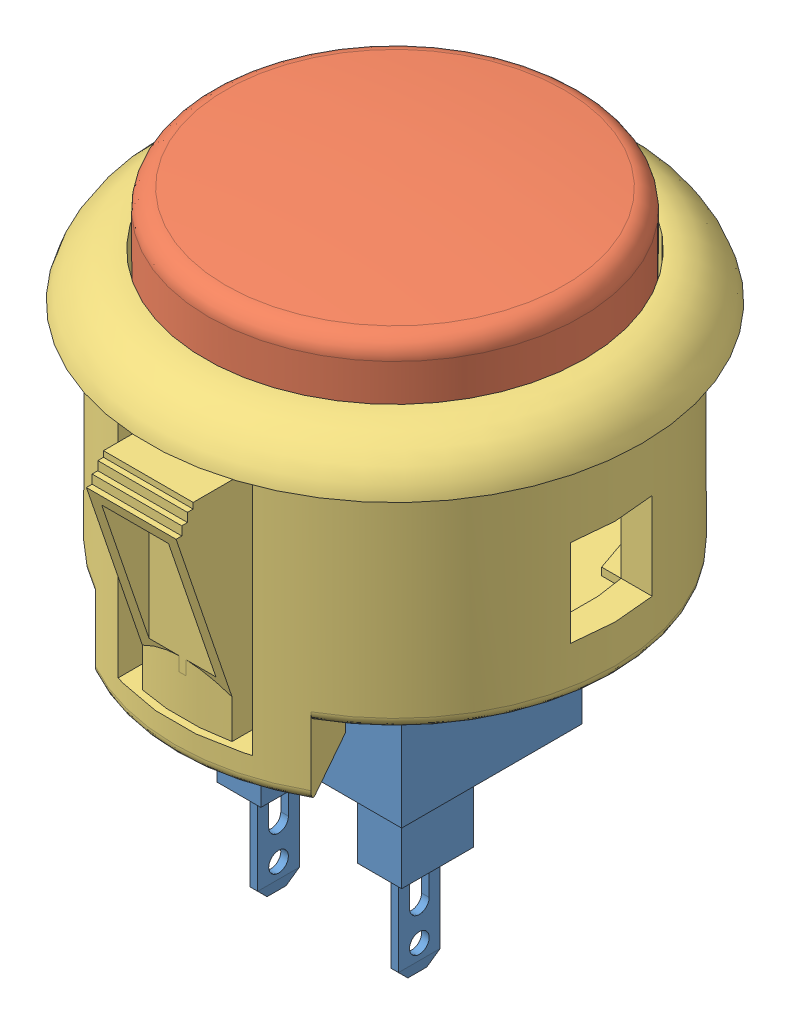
SolidWorks assembly button.SLDASM, configuration Default (file format 9000). Lengths in mm.
Overall size (33.02 54.9 35.3).
3 component instances, 3 part files, 6 mates.
Components (placement in the parent):
- microswitch-1: microswitch.SLDPRT [Default] at (13.0575 17.8228 12.0437) x (1 0 0) z (0 1 0) size (15.01 12.07 29.85)
- top_cap-1: top_cap.SLDPRT [Default] at (13.0575 43.2282 12.0437) size (26.67 15.14 24.94)
- base__-1: base__.SLDPRT [Default] at (13.0575 42.1024 12.0437) size (33.02 50.74 35.3)
Mates (geometry in assembly coordinates):
- Parallel1: parallel aligned: plane of microswitch-1 through (12.2955 37.1268 15.0536) normal (-1 0 0); plane of top_cap-1 through (13.9465 53.6122 8.9576) normal (-1 0 0)
- LimitDistance1: limit distance = 3.6068 mm anti-aligned: plane of top_cap-1 through (21.09 34.1296 12.0437) normal (0 -1 0); plane of microswitch-1 through (6.5805 30.5228 18.0762) normal (0 1 0)
- Concêntrico1: concentric anti-aligned: cylinder of top_cap-1 through (13.0575 43.2282 12.0437) axis (0 -1 0) radius 12.4714; cylinder of base__-1 through (13.0575 45.1024 12.0437) axis (0 1 0) radius 12.7
- Coincidente2: coincident anti-aligned: plane of top_cap-1 through (13.0575 36.7204 -17.4347) normal (0 1 0); plane of base__-1 through (-3.4525 36.7204 14.7742) normal (0 -1 0)
- Coincidente3: coincident anti-aligned: plane of microswitch-1 through (6.5805 30.5228 18.0762) normal (0 0 1); plane of base__-1 through (19.5345 45.1034 18.0762) normal (0 0 -1)
- Coincidente4: coincident anti-aligned: plane of microswitch-1 through (19.5345 30.5228 6.0112) normal (1 0 0); plane of base__-1 through (19.5345 45.1034 18.0762) normal (-1 0 0)
